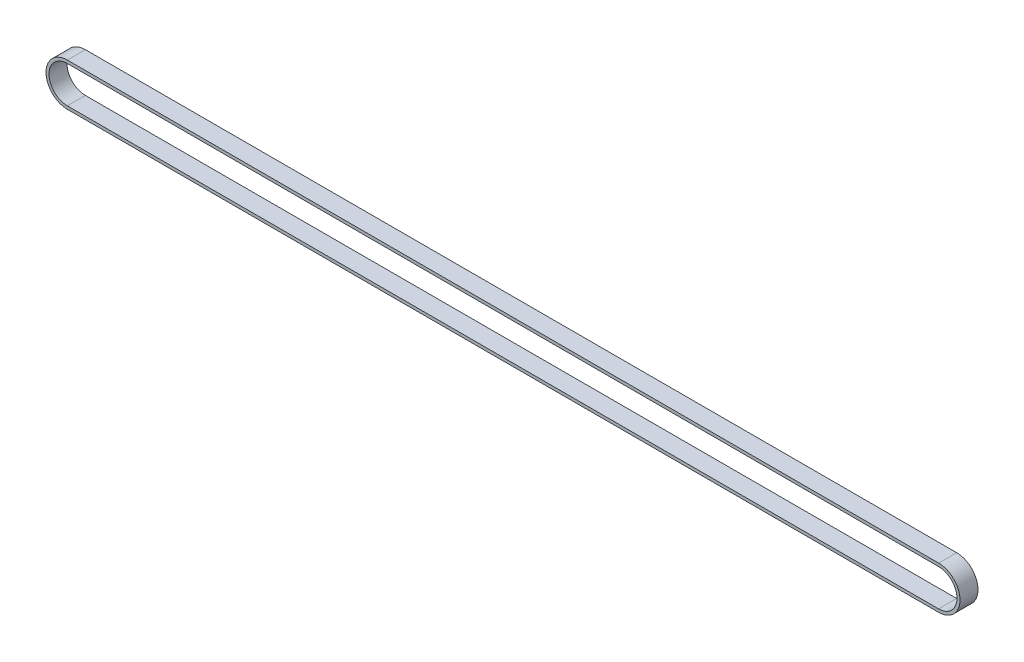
ISO-10303-21;
HEADER;
FILE_DESCRIPTION(('STEP AP214'),'2;1');
FILE_NAME('part.step','',(''),(''),'','','');
FILE_SCHEMA(('AUTOMOTIVE_DESIGN { 1 0 10303 214 1 1 1 1 }'));
ENDSEC;
DATA;
#1=APPLICATION_CONTEXT('core data for automotive mechanical design processes');
#2=APPLICATION_PROTOCOL_DEFINITION('international standard','automotive_design',2000,#1);
#3=PRODUCT_CONTEXT('',#1,'mechanical');
#4=PRODUCT('Part','Part','',(#3));
#5=PRODUCT_RELATED_PRODUCT_CATEGORY('part','',(#4));
#6=PRODUCT_DEFINITION_FORMATION('','',#4);
#7=PRODUCT_DEFINITION_CONTEXT('part definition',#1,'design');
#8=PRODUCT_DEFINITION('design','',#6,#7);
#9=PRODUCT_DEFINITION_SHAPE('','',#8);
#10=(LENGTH_UNIT() NAMED_UNIT(*) SI_UNIT(.MILLI.,.METRE.));
#11=(NAMED_UNIT(*) PLANE_ANGLE_UNIT() SI_UNIT($,.RADIAN.));
#12=(NAMED_UNIT(*) SI_UNIT($,.STERADIAN.) SOLID_ANGLE_UNIT());
#13=UNCERTAINTY_MEASURE_WITH_UNIT(LENGTH_MEASURE(1.E-05),#10,'distance_accuracy_value','');
#14=(GEOMETRIC_REPRESENTATION_CONTEXT(3) GLOBAL_UNCERTAINTY_ASSIGNED_CONTEXT((#13)) GLOBAL_UNIT_ASSIGNED_CONTEXT((#10,
#11,#12)) REPRESENTATION_CONTEXT('',''));
#15=CARTESIAN_POINT('',(0.,0.,0.));
#16=DIRECTION('',(0.,0.,1.));
#17=DIRECTION('',(1.,0.,0.));
#18=AXIS2_PLACEMENT_3D('',#15,#16,#17);
#19=CARTESIAN_POINT('',(0.,0.,6.));
#20=DIRECTION('',(0.,0.,1.));
#21=DIRECTION('',(1.,0.,0.));
#22=AXIS2_PLACEMENT_3D('',#19,#20,#21);
#23=PLANE('',#22);
#24=CARTESIAN_POINT('',(0.,0.,6.));
#25=DIRECTION('',(0.,0.,1.));
#26=DIRECTION('',(1.,0.,0.));
#27=AXIS2_PLACEMENT_3D('',#24,#25,#26);
#28=CIRCLE('',#27,7.1);
#29=CARTESIAN_POINT('',(0.,7.1,6.));
#30=VERTEX_POINT('',#29);
#31=CARTESIAN_POINT('',(0.,-7.1,6.));
#32=VERTEX_POINT('',#31);
#33=EDGE_CURVE('E136',#30,#32,#28,.T.);
#34=ORIENTED_EDGE('',*,*,#33,.T.);
#35=DIRECTION('',(1.,0.,0.));
#36=VECTOR('',#35,1.);
#37=CARTESIAN_POINT('',(0.,-7.1,6.));
#38=LINE('',#37,#36);
#39=CARTESIAN_POINT('',(290.,-7.1,6.));
#40=VERTEX_POINT('',#39);
#41=EDGE_CURVE('E139',#32,#40,#38,.T.);
#42=ORIENTED_EDGE('',*,*,#41,.T.);
#43=CARTESIAN_POINT('',(290.,0.,6.));
#44=DIRECTION('',(0.,0.,1.));
#45=DIRECTION('',(1.,0.,0.));
#46=AXIS2_PLACEMENT_3D('',#43,#44,#45);
#47=CIRCLE('',#46,7.1);
#48=CARTESIAN_POINT('',(290.,7.1,6.));
#49=VERTEX_POINT('',#48);
#50=EDGE_CURVE('E142',#40,#49,#47,.T.);
#51=ORIENTED_EDGE('',*,*,#50,.T.);
#52=DIRECTION('',(-1.,0.,0.));
#53=VECTOR('',#52,1.);
#54=CARTESIAN_POINT('',(0.,7.1,6.));
#55=LINE('',#54,#53);
#56=EDGE_CURVE('E144',#49,#30,#55,.T.);
#57=ORIENTED_EDGE('',*,*,#56,.T.);
#58=EDGE_LOOP('',(#34,#42,#51,#57));
#59=FACE_BOUND('',#58,.T.);
#60=DIRECTION('',(1.,0.,0.));
#61=VECTOR('',#60,1.);
#62=CARTESIAN_POINT('',(0.,-6.1,6.));
#63=LINE('',#62,#61);
#64=CARTESIAN_POINT('',(0.,-6.1,6.));
#65=VERTEX_POINT('',#64);
#66=CARTESIAN_POINT('',(290.,-6.1,6.));
#67=VERTEX_POINT('',#66);
#68=EDGE_CURVE('E108',#65,#67,#63,.T.);
#69=ORIENTED_EDGE('',*,*,#68,.F.);
#70=CARTESIAN_POINT('',(0.,0.,6.));
#71=DIRECTION('',(0.,0.,1.));
#72=DIRECTION('',(1.,0.,0.));
#73=AXIS2_PLACEMENT_3D('',#70,#71,#72);
#74=CIRCLE('',#73,6.1);
#75=CARTESIAN_POINT('',(0.,6.1,6.));
#76=VERTEX_POINT('',#75);
#77=EDGE_CURVE('E100',#76,#65,#74,.T.);
#78=ORIENTED_EDGE('',*,*,#77,.F.);
#79=DIRECTION('',(-1.,0.,0.));
#80=VECTOR('',#79,1.);
#81=CARTESIAN_POINT('',(0.,6.1,6.));
#82=LINE('',#81,#80);
#83=CARTESIAN_POINT('',(290.,6.1,6.));
#84=VERTEX_POINT('',#83);
#85=EDGE_CURVE('E122',#84,#76,#82,.T.);
#86=ORIENTED_EDGE('',*,*,#85,.F.);
#87=CARTESIAN_POINT('',(290.,0.,6.));
#88=DIRECTION('',(0.,0.,1.));
#89=DIRECTION('',(1.,0.,0.));
#90=AXIS2_PLACEMENT_3D('',#87,#88,#89);
#91=CIRCLE('',#90,6.1);
#92=EDGE_CURVE('E120',#67,#84,#91,.T.);
#93=ORIENTED_EDGE('',*,*,#92,.F.);
#94=EDGE_LOOP('',(#69,#78,#86,#93));
#95=FACE_BOUND('',#94,.T.);
#96=ADVANCED_FACE('F35',(#59,#95),#23,.T.);
#97=CARTESIAN_POINT('',(0.,0.,0.));
#98=DIRECTION('',(0.,0.,1.));
#99=DIRECTION('',(1.,0.,0.));
#100=AXIS2_PLACEMENT_3D('',#97,#98,#99);
#101=PLANE('',#100);
#102=CARTESIAN_POINT('',(0.,0.,0.));
#103=DIRECTION('',(0.,0.,1.));
#104=DIRECTION('',(1.,0.,0.));
#105=AXIS2_PLACEMENT_3D('',#102,#103,#104);
#106=CIRCLE('',#105,7.1);
#107=CARTESIAN_POINT('',(0.,7.1,0.));
#108=VERTEX_POINT('',#107);
#109=CARTESIAN_POINT('',(0.,-7.1,0.));
#110=VERTEX_POINT('',#109);
#111=EDGE_CURVE('E116',#108,#110,#106,.T.);
#112=ORIENTED_EDGE('',*,*,#111,.F.);
#113=DIRECTION('',(-1.,0.,0.));
#114=VECTOR('',#113,1.);
#115=CARTESIAN_POINT('',(0.,7.1,0.));
#116=LINE('',#115,#114);
#117=CARTESIAN_POINT('',(290.,7.1,0.));
#118=VERTEX_POINT('',#117);
#119=EDGE_CURVE('E140',#118,#108,#116,.T.);
#120=ORIENTED_EDGE('',*,*,#119,.F.);
#121=CARTESIAN_POINT('',(290.,0.,0.));
#122=DIRECTION('',(0.,0.,1.));
#123=DIRECTION('',(1.,0.,0.));
#124=AXIS2_PLACEMENT_3D('',#121,#122,#123);
#125=CIRCLE('',#124,7.1);
#126=CARTESIAN_POINT('',(290.,-7.1,0.));
#127=VERTEX_POINT('',#126);
#128=EDGE_CURVE('E151',#127,#118,#125,.T.);
#129=ORIENTED_EDGE('',*,*,#128,.F.);
#130=DIRECTION('',(1.,0.,0.));
#131=VECTOR('',#130,1.);
#132=CARTESIAN_POINT('',(0.,-7.1,0.));
#133=LINE('',#132,#131);
#134=EDGE_CURVE('E149',#110,#127,#133,.T.);
#135=ORIENTED_EDGE('',*,*,#134,.F.);
#136=EDGE_LOOP('',(#112,#120,#129,#135));
#137=FACE_BOUND('',#136,.T.);
#138=CARTESIAN_POINT('',(0.,0.,0.));
#139=DIRECTION('',(0.,0.,1.));
#140=DIRECTION('',(1.,0.,0.));
#141=AXIS2_PLACEMENT_3D('',#138,#139,#140);
#142=CIRCLE('',#141,6.1);
#143=CARTESIAN_POINT('',(0.,6.1,0.));
#144=VERTEX_POINT('',#143);
#145=CARTESIAN_POINT('',(0.,-6.1,0.));
#146=VERTEX_POINT('',#145);
#147=EDGE_CURVE('E58',#144,#146,#142,.T.);
#148=ORIENTED_EDGE('',*,*,#147,.T.);
#149=DIRECTION('',(1.,0.,0.));
#150=VECTOR('',#149,1.);
#151=CARTESIAN_POINT('',(0.,-6.1,0.));
#152=LINE('',#151,#150);
#153=CARTESIAN_POINT('',(290.,-6.1,0.));
#154=VERTEX_POINT('',#153);
#155=EDGE_CURVE('E115',#146,#154,#152,.T.);
#156=ORIENTED_EDGE('',*,*,#155,.T.);
#157=CARTESIAN_POINT('',(290.,0.,0.));
#158=DIRECTION('',(0.,0.,1.));
#159=DIRECTION('',(1.,0.,0.));
#160=AXIS2_PLACEMENT_3D('',#157,#158,#159);
#161=CIRCLE('',#160,6.1);
#162=CARTESIAN_POINT('',(290.,6.1,0.));
#163=VERTEX_POINT('',#162);
#164=EDGE_CURVE('E128',#154,#163,#161,.T.);
#165=ORIENTED_EDGE('',*,*,#164,.T.);
#166=DIRECTION('',(-1.,0.,0.));
#167=VECTOR('',#166,1.);
#168=CARTESIAN_POINT('',(0.,6.1,0.));
#169=LINE('',#168,#167);
#170=EDGE_CURVE('E109',#163,#144,#169,.T.);
#171=ORIENTED_EDGE('',*,*,#170,.T.);
#172=EDGE_LOOP('',(#148,#156,#165,#171));
#173=FACE_BOUND('',#172,.T.);
#174=ADVANCED_FACE('F169',(#137,#173),#101,.F.);
#175=CARTESIAN_POINT('',(0.,0.,6.));
#176=DIRECTION('',(0.,0.,-1.));
#177=DIRECTION('',(-1.,0.,0.));
#178=AXIS2_PLACEMENT_3D('',#175,#176,#177);
#179=CYLINDRICAL_SURFACE('',#178,7.1);
#180=ORIENTED_EDGE('',*,*,#111,.T.);
#181=DIRECTION('',(0.,0.,-1.));
#182=VECTOR('',#181,1.);
#183=CARTESIAN_POINT('',(0.,-7.1,6.));
#184=LINE('',#183,#182);
#185=EDGE_CURVE('E11',#32,#110,#184,.T.);
#186=ORIENTED_EDGE('',*,*,#185,.F.);
#187=ORIENTED_EDGE('',*,*,#33,.F.);
#188=DIRECTION('',(0.,0.,-1.));
#189=VECTOR('',#188,1.);
#190=CARTESIAN_POINT('',(0.,7.1,6.));
#191=LINE('',#190,#189);
#192=EDGE_CURVE('E146',#30,#108,#191,.T.);
#193=ORIENTED_EDGE('',*,*,#192,.T.);
#194=EDGE_LOOP('',(#180,#186,#187,#193));
#195=FACE_BOUND('',#194,.T.);
#196=ADVANCED_FACE('F37',(#195),#179,.T.);
#197=CARTESIAN_POINT('',(0.,-7.1,6.));
#198=DIRECTION('',(0.,1.,0.));
#199=DIRECTION('',(-1.,0.,0.));
#200=AXIS2_PLACEMENT_3D('',#197,#198,#199);
#201=PLANE('',#200);
#202=ORIENTED_EDGE('',*,*,#134,.T.);
#203=DIRECTION('',(0.,0.,-1.));
#204=VECTOR('',#203,1.);
#205=CARTESIAN_POINT('',(290.,-7.1,6.));
#206=LINE('',#205,#204);
#207=EDGE_CURVE('E43',#40,#127,#206,.T.);
#208=ORIENTED_EDGE('',*,*,#207,.F.);
#209=ORIENTED_EDGE('',*,*,#41,.F.);
#210=ORIENTED_EDGE('',*,*,#185,.T.);
#211=EDGE_LOOP('',(#202,#208,#209,#210));
#212=FACE_BOUND('',#211,.T.);
#213=ADVANCED_FACE('F179',(#212),#201,.F.);
#214=CARTESIAN_POINT('',(290.,0.,6.));
#215=DIRECTION('',(0.,0.,-1.));
#216=DIRECTION('',(-1.,0.,0.));
#217=AXIS2_PLACEMENT_3D('',#214,#215,#216);
#218=CYLINDRICAL_SURFACE('',#217,7.1);
#219=ORIENTED_EDGE('',*,*,#128,.T.);
#220=DIRECTION('',(0.,0.,-1.));
#221=VECTOR('',#220,1.);
#222=CARTESIAN_POINT('',(290.,7.1,6.));
#223=LINE('',#222,#221);
#224=EDGE_CURVE('E156',#49,#118,#223,.T.);
#225=ORIENTED_EDGE('',*,*,#224,.F.);
#226=ORIENTED_EDGE('',*,*,#50,.F.);
#227=ORIENTED_EDGE('',*,*,#207,.T.);
#228=EDGE_LOOP('',(#219,#225,#226,#227));
#229=FACE_BOUND('',#228,.T.);
#230=ADVANCED_FACE('F163',(#229),#218,.T.);
#231=CARTESIAN_POINT('',(0.,7.1,6.));
#232=DIRECTION('',(0.,-1.,0.));
#233=DIRECTION('',(1.,0.,0.));
#234=AXIS2_PLACEMENT_3D('',#231,#232,#233);
#235=PLANE('',#234);
#236=ORIENTED_EDGE('',*,*,#119,.T.);
#237=ORIENTED_EDGE('',*,*,#192,.F.);
#238=ORIENTED_EDGE('',*,*,#56,.F.);
#239=ORIENTED_EDGE('',*,*,#224,.T.);
#240=EDGE_LOOP('',(#236,#237,#238,#239));
#241=FACE_BOUND('',#240,.T.);
#242=ADVANCED_FACE('F173',(#241),#235,.F.);
#243=CARTESIAN_POINT('',(0.,0.,6.));
#244=DIRECTION('',(0.,0.,-1.));
#245=DIRECTION('',(-1.,0.,0.));
#246=AXIS2_PLACEMENT_3D('',#243,#244,#245);
#247=CYLINDRICAL_SURFACE('',#246,6.1);
#248=ORIENTED_EDGE('',*,*,#147,.F.);
#249=DIRECTION('',(0.,0.,-1.));
#250=VECTOR('',#249,1.);
#251=CARTESIAN_POINT('',(0.,6.1,6.));
#252=LINE('',#251,#250);
#253=EDGE_CURVE('E104',#76,#144,#252,.T.);
#254=ORIENTED_EDGE('',*,*,#253,.F.);
#255=ORIENTED_EDGE('',*,*,#77,.T.);
#256=DIRECTION('',(0.,0.,-1.));
#257=VECTOR('',#256,1.);
#258=CARTESIAN_POINT('',(0.,-6.1,6.));
#259=LINE('',#258,#257);
#260=EDGE_CURVE('E103',#65,#146,#259,.T.);
#261=ORIENTED_EDGE('',*,*,#260,.T.);
#262=EDGE_LOOP('',(#248,#254,#255,#261));
#263=FACE_BOUND('',#262,.T.);
#264=ADVANCED_FACE('F102',(#263),#247,.F.);
#265=CARTESIAN_POINT('',(0.,-6.1,6.));
#266=DIRECTION('',(0.,1.,0.));
#267=DIRECTION('',(-1.,0.,0.));
#268=AXIS2_PLACEMENT_3D('',#265,#266,#267);
#269=PLANE('',#268);
#270=ORIENTED_EDGE('',*,*,#155,.F.);
#271=ORIENTED_EDGE('',*,*,#260,.F.);
#272=ORIENTED_EDGE('',*,*,#68,.T.);
#273=DIRECTION('',(0.,0.,-1.));
#274=VECTOR('',#273,1.);
#275=CARTESIAN_POINT('',(290.,-6.1,6.));
#276=LINE('',#275,#274);
#277=EDGE_CURVE('E117',#67,#154,#276,.T.);
#278=ORIENTED_EDGE('',*,*,#277,.T.);
#279=EDGE_LOOP('',(#270,#271,#272,#278));
#280=FACE_BOUND('',#279,.T.);
#281=ADVANCED_FACE('F112',(#280),#269,.T.);
#282=CARTESIAN_POINT('',(290.,0.,6.));
#283=DIRECTION('',(0.,0.,-1.));
#284=DIRECTION('',(-1.,0.,0.));
#285=AXIS2_PLACEMENT_3D('',#282,#283,#284);
#286=CYLINDRICAL_SURFACE('',#285,6.1);
#287=ORIENTED_EDGE('',*,*,#164,.F.);
#288=ORIENTED_EDGE('',*,*,#277,.F.);
#289=ORIENTED_EDGE('',*,*,#92,.T.);
#290=DIRECTION('',(0.,0.,-1.));
#291=VECTOR('',#290,1.);
#292=CARTESIAN_POINT('',(290.,6.1,6.));
#293=LINE('',#292,#291);
#294=EDGE_CURVE('E50',#84,#163,#293,.T.);
#295=ORIENTED_EDGE('',*,*,#294,.T.);
#296=EDGE_LOOP('',(#287,#288,#289,#295));
#297=FACE_BOUND('',#296,.T.);
#298=ADVANCED_FACE('F202',(#297),#286,.F.);
#299=CARTESIAN_POINT('',(0.,6.1,6.));
#300=DIRECTION('',(0.,-1.,0.));
#301=DIRECTION('',(1.,0.,0.));
#302=AXIS2_PLACEMENT_3D('',#299,#300,#301);
#303=PLANE('',#302);
#304=ORIENTED_EDGE('',*,*,#170,.F.);
#305=ORIENTED_EDGE('',*,*,#294,.F.);
#306=ORIENTED_EDGE('',*,*,#85,.T.);
#307=ORIENTED_EDGE('',*,*,#253,.T.);
#308=EDGE_LOOP('',(#304,#305,#306,#307));
#309=FACE_BOUND('',#308,.T.);
#310=ADVANCED_FACE('F206',(#309),#303,.T.);
#311=CLOSED_SHELL('',(#96,#174,#196,#213,#230,#242,#264,#281,#298,#310));
#312=MANIFOLD_SOLID_BREP('B2',#311);
#313=ADVANCED_BREP_SHAPE_REPRESENTATION('',(#18,#312),#14);
#314=SHAPE_DEFINITION_REPRESENTATION(#9,#313);
ENDSEC;
END-ISO-10303-21;
